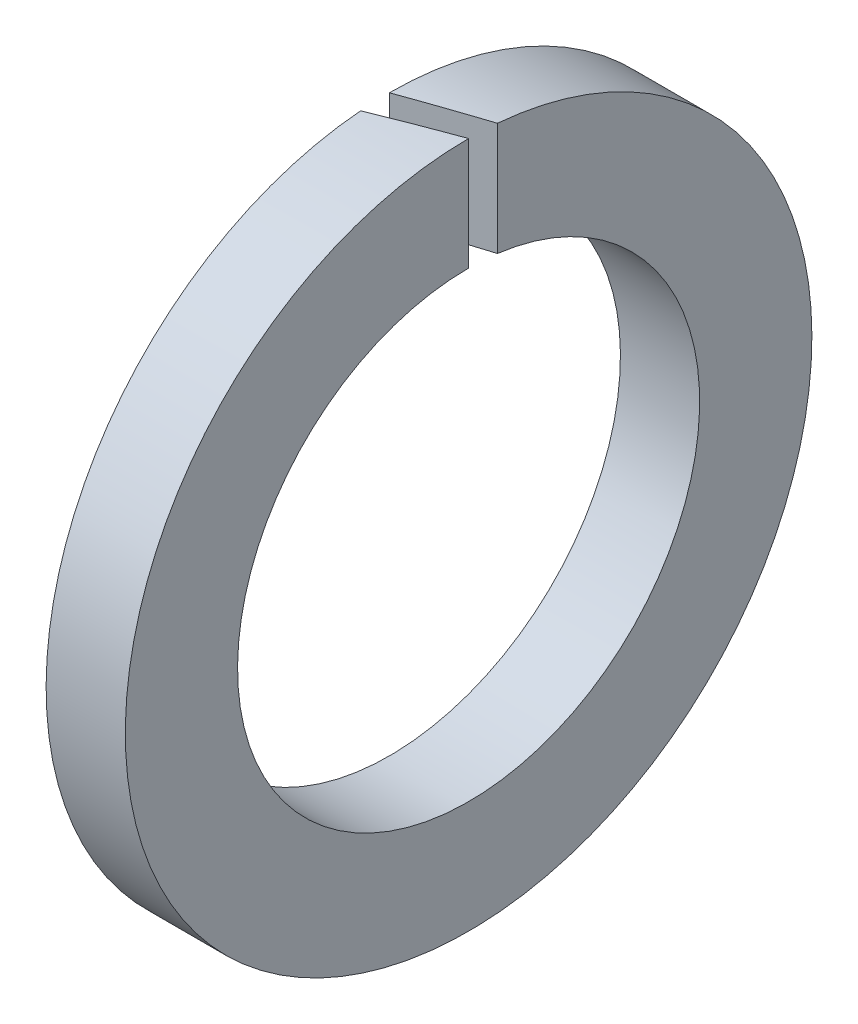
from build123d import *

# Parameters (mm, degrees)
ESQUISSE1_W             = 0.6
ESQUISSE1_H             = 0.85
ENL_V_MAT_EXTRU_1_DEPTH = 4.725587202


with BuildPart() as part:
    # Esquisse1 → Base-R_volution (revolve)
    with BuildSketch(Plane(origin=(0, 0, 0), x_dir=(1, 0, 0), z_dir=(0, 1, 0)), mode=Mode.PRIVATE) as base_r_volution_sk:
        with Locations((0.3, 2.175)):
            Rectangle(ESQUISSE1_W, ESQUISSE1_H)
    revolve(base_r_volution_sk.sketch.rotate(Axis((0, 0, 0), (1, 0, 0)), 180), axis=Axis((0, 0, 0), (1, 0, 0)))

    # Esquisse2 → Enl_v. mat.-Extru.1 (cut, through all)
    with BuildSketch(Plane(origin=(0, 0, 0), x_dir=(1, 0, 0), z_dir=(0, 1, 0))):
        Polygon((0, 0), (0.6, 0.218382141), (0.6, 0), (0, -0.218382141), align=None)
    extrude(amount=ENL_V_MAT_EXTRU_1_DEPTH, mode=Mode.SUBTRACT)


solid = part.part
